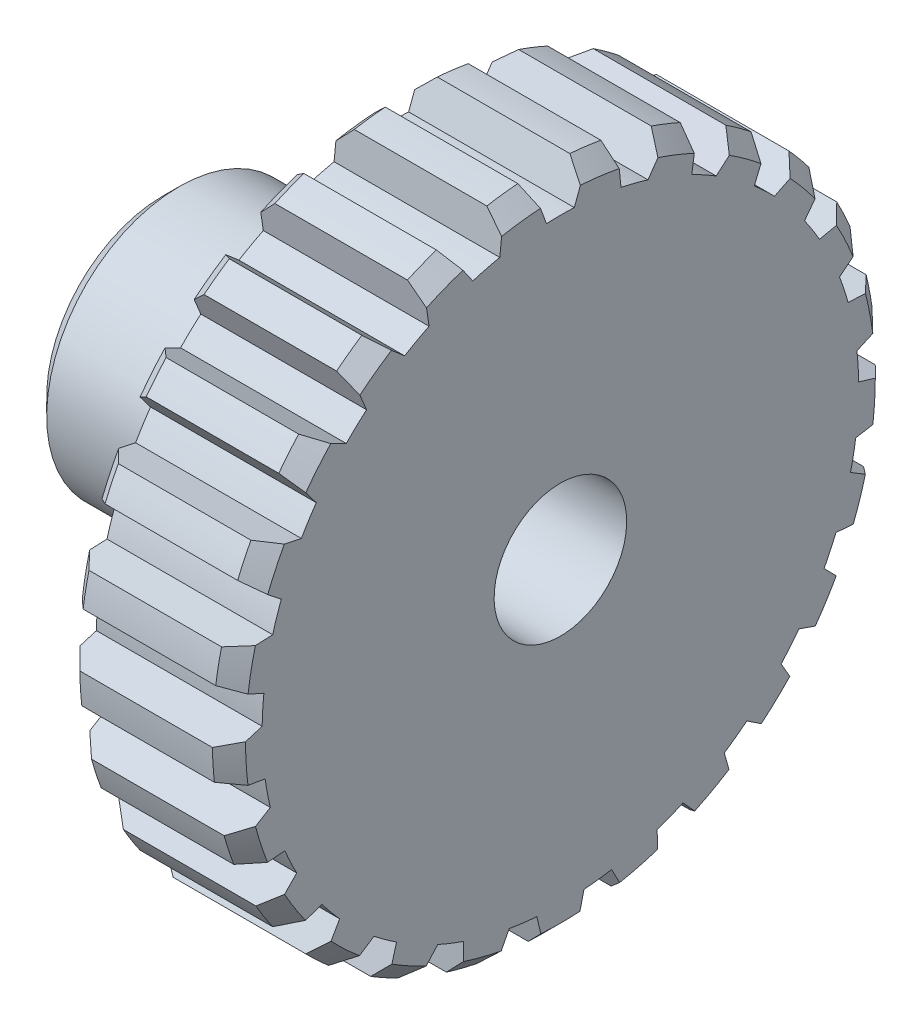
from build123d import *

# Parameters (mm, degrees)
CHAMFER4_SIZE      = 0.5
CUT_EXTRUDE2_DEPTH = 10
SCALE3_SCALE       = 0.85


with BuildPart() as part:
    # Sketch1 → Revolve1 (revolve)
    with BuildSketch(Plane.XY):
        Polygon((0, 2), (-12, 2), (-12, 4), (-5, 4), (-5, 10), (0, 10), align=None)
    revolve(axis=Axis((0, 0, 0), (-1, 0, 0)))

    # Chamfer4
    chamfer4_edges = [part.edges().sort_by_distance(p)[0] for p in [
        (-12, -4, 0),
        (-5, -10, 0),
        (0, -10, 0),
    ]]
    chamfer(chamfer4_edges, length=CHAMFER4_SIZE)

    # Sketch3 → Cut-Extrude2 (cut)
    with BuildSketch(Plane(origin=(0, 0, 0), x_dir=(0, 0, -1), z_dir=(1, 0, 0))):
        with BuildLine():
            Line((-0.785, 9.969141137), (-0.42, 8.990194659))
            ThreePointArc((-0.42, 8.990194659), (0, 9), (0.42, 8.990194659))
            Line((0.42, 8.990194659), (0.785, 9.969141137))
            Line((0.785, 9.969141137), (0.785, 10.77942288))
            ThreePointArc((0.785, 10.77942288), (0, 10.807968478), (-0.785, 10.77942288))
            Line((-0.785, 10.77942288), (-0.785, 9.969141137))
        make_face()
        with BuildLine():
            Line((1.920395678, 10.63598905), (1.718886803, 9.851163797))
            Line((1.718886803, 9.851163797), (1.828965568, 8.812200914))
            ThreePointArc((1.828965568, 8.812200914), (2.238208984, 8.71724845), (2.642575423, 8.603301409))
            Line((2.642575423, 8.603301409), (3.239562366, 9.460720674))
            Line((3.239562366, 9.460720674), (3.441071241, 10.245545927))
            ThreePointArc((3.441071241, 10.245545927), (2.687832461, 10.468416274), (1.920395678, 10.63598905))
        make_face()
        with BuildLine():
            Line((4.505125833, 9.824256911), (4.114769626, 9.114201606))
            Line((4.114769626, 9.114201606), (3.963010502, 8.080504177))
            ThreePointArc((3.963010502, 8.080504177), (4.335783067, 7.88676012), (4.699108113, 7.675831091))
            Line((4.699108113, 7.675831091), (5.490571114, 8.357848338))
            Line((5.490571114, 8.357848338), (5.880927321, 9.067903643))
            ThreePointArc((5.880927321, 9.067903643), (5.206778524, 9.471094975), (4.505125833, 9.824256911))
        make_face()
        with BuildLine():
            Line((6.806782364, 8.39523058), (6.252106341, 7.804560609))
            Line((6.252106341, 7.804560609), (5.848044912, 6.841079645))
            ThreePointArc((5.848044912, 6.841079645), (6.160923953, 6.560717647), (6.460378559, 6.266060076))
            Line((6.460378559, 6.266060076), (7.396587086, 6.729821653))
            Line((7.396587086, 6.729821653), (7.951263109, 7.320491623))
            ThreePointArc((7.951263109, 7.320491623), (7.398563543, 7.878669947), (6.806782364, 8.39523058))
        make_face()
        with BuildLine():
            Line((8.680743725, 6.438701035), (7.996600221, 6.004530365))
            Line((7.996600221, 6.004530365), (7.365625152, 5.171804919))
            ThreePointArc((7.365625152, 5.171804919), (7.59895133, 4.822441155), (7.81571966, 4.462569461))
            Line((7.81571966, 4.462569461), (8.837848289, 4.678935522))
            Line((8.837848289, 4.678935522), (9.521991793, 5.113106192))
            ThreePointArc((9.521991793, 5.113106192), (9.125469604, 5.79119911), (8.680743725, 6.438701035))
        make_face()
        with BuildLine():
            Line((10.009262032, 4.077604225), (9.238638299, 3.827213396))
            Line((9.238638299, 3.827213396), (8.420396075, 3.177566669))
            ThreePointArc((8.420396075, 3.177566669), (8.559508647, 2.781152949), (8.67997035, 2.378679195))
            Line((8.67997035, 2.378679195), (9.72379498, 2.334054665))
            Line((9.72379498, 2.334054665), (10.494418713, 2.584445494))
            ThreePointArc((10.494418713, 2.584445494), (10.278988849, 3.339845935), (10.009262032, 4.077604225))
        make_face()
        with BuildLine():
            Line((10.708861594, 1.460296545), (9.900178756, 1.409418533))
            Line((9.900178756, 1.409418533), (8.946082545, 0.983670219))
            ThreePointArc((8.946082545, 0.983670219), (8.982240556, 0.565114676), (8.998826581, 0.145327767))
            Line((8.998826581, 0.145327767), (9.998759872, -0.157483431))
            Line((9.998759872, -0.157483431), (10.807442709, -0.106605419))
            ThreePointArc((10.807442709, -0.106605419), (10.786641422, 0.678637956), (10.708861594, 1.460296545))
        make_face()
        with BuildLine():
            Line((10.735583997, -1.248766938), (9.939654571, -1.09693528))
            Line((9.939654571, -1.09693528), (8.909653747, -1.272033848))
            ThreePointArc((8.909653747, -1.272033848), (8.840585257, -1.686431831), (8.752253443, -2.097155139))
            Line((8.752253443, -2.097155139), (9.645465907, -2.639126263))
            Line((9.645465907, -2.639126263), (10.441395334, -2.790957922))
            ThreePointArc((10.441395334, -2.790957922), (10.616529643, -2.025211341), (10.735583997, -1.248766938))
        make_face()
        with BuildLine():
            Line((10.087750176, -3.879365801), (9.354585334, -3.534364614))
            Line((9.354585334, -3.534364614), (8.313398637, -3.447811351))
            ThreePointArc((8.313398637, -3.447811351), (8.143443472, -3.832013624), (7.955744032, -4.207866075))
            Line((7.955744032, -4.207866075), (8.686111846, -4.954943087))
            Line((8.686111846, -4.954943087), (9.419276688, -5.299944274))
            ThreePointArc((9.419276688, -5.299944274), (9.779342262, -4.601809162), (10.087750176, -3.879365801))
        make_face()
        with BuildLine():
            Line((8.806065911, -6.266209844), (8.181733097, -5.749716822))
            Line((8.181733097, -5.749716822), (7.194782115, -5.406950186))
            ThreePointArc((7.194782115, -5.406950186), (6.934619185, -5.736815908), (6.659345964, -6.05418131))
            Line((6.659345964, -6.05418131), (7.180977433, -6.959422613))
            Line((7.180977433, -6.959422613), (7.805310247, -7.475915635))
            ThreePointArc((7.805310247, -7.475915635), (8.32768284, -6.889258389), (8.806065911, -6.266209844))
        make_face()
        with BuildLine():
            Line((6.971064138, -8.259324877), (6.494792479, -7.603793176))
            Line((6.494792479, -7.603793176), (5.624090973, -7.026350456))
            ThreePointArc((5.624090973, -7.026350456), (5.290067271, -7.281152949), (4.944516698, -7.520090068))
            Line((4.944516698, -7.520090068), (5.224635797, -8.526616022))
            Line((5.224635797, -8.526616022), (5.700907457, -9.182147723))
            ThreePointArc((5.700907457, -9.182147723), (6.352764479, -8.743830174), (6.971064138, -8.259324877))
        make_face()
        with BuildLine():
            Line((4.698044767, -9.733476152), (4.399760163, -8.980095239))
            Line((4.399760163, -8.980095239), (3.700017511, -8.204259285))
            ThreePointArc((3.700017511, -8.204259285), (3.313120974, -8.367988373), (2.919005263, -8.513483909))
            Line((2.919005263, -8.513483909), (2.94001108, -9.558050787))
            Line((2.94001108, -9.558050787), (3.238295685, -10.311431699))
            ThreePointArc((3.238295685, -10.311431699), (3.978678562, -10.048994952), (4.698044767, -9.733476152))
        make_face()
        with BuildLine():
            Line((2.129829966, -10.596037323), (2.028274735, -9.792144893))
            Line((2.028274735, -9.792144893), (1.543458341, -8.86666433))
            ThreePointArc((1.543458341, -8.86666433), (1.127999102, -8.929032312), (0.710081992, -8.971944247))
            Line((0.710081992, -8.971944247), (0.470654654, -9.988918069))
            Line((0.470654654, -9.988918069), (0.572209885, -10.7928105))
            ThreePointArc((0.572209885, -10.7928105), (1.354597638, -10.722744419), (2.129829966, -10.596037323))
        make_face()
        with BuildLine():
            Line((-0.572209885, -10.7928105), (-0.470654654, -9.988918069))
            Line((-0.470654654, -9.988918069), (-0.710081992, -8.971944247))
            ThreePointArc((-0.710081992, -8.971944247), (-1.127999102, -8.929032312), (-1.543458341, -8.86666433))
            Line((-1.543458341, -8.86666433), (-2.028274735, -9.792144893))
            Line((-2.028274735, -9.792144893), (-2.129829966, -10.596037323))
            ThreePointArc((-2.129829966, -10.596037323), (-1.354597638, -10.722744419), (-0.572209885, -10.7928105))
        make_face()
        with BuildLine():
            Line((-3.238295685, -10.311431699), (-2.94001108, -9.558050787))
            Line((-2.94001108, -9.558050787), (-2.919005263, -8.513483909))
            ThreePointArc((-2.919005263, -8.513483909), (-3.313120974, -8.367988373), (-3.700017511, -8.204259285))
            Line((-3.700017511, -8.204259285), (-4.399760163, -8.980095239))
            Line((-4.399760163, -8.980095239), (-4.698044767, -9.733476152))
            ThreePointArc((-4.698044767, -9.733476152), (-3.978678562, -10.048994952), (-3.238295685, -10.311431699))
        make_face()
        with BuildLine():
            Line((-5.700907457, -9.182147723), (-5.224635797, -8.526616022))
            Line((-5.224635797, -8.526616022), (-4.944516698, -7.520090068))
            ThreePointArc((-4.944516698, -7.520090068), (-5.290067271, -7.281152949), (-5.624090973, -7.026350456))
            Line((-5.624090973, -7.026350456), (-6.494792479, -7.603793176))
            Line((-6.494792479, -7.603793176), (-6.971064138, -8.259324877))
            ThreePointArc((-6.971064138, -8.259324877), (-6.352764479, -8.743830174), (-5.700907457, -9.182147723))
        make_face()
        with BuildLine():
            Line((-7.805310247, -7.475915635), (-7.180977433, -6.959422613))
            Line((-7.180977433, -6.959422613), (-6.659345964, -6.05418131))
            ThreePointArc((-6.659345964, -6.05418131), (-6.934619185, -5.736815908), (-7.194782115, -5.406950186))
            Line((-7.194782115, -5.406950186), (-8.181733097, -5.749716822))
            Line((-8.181733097, -5.749716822), (-8.806065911, -6.266209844))
            ThreePointArc((-8.806065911, -6.266209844), (-8.32768284, -6.889258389), (-7.805310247, -7.475915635))
        make_face()
        with BuildLine():
            Line((-9.419276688, -5.299944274), (-8.686111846, -4.954943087))
            Line((-8.686111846, -4.954943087), (-7.955744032, -4.207866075))
            ThreePointArc((-7.955744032, -4.207866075), (-8.143443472, -3.832013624), (-8.313398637, -3.447811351))
            Line((-8.313398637, -3.447811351), (-9.354585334, -3.534364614))
            Line((-9.354585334, -3.534364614), (-10.087750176, -3.879365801))
            ThreePointArc((-10.087750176, -3.879365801), (-9.779342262, -4.601809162), (-9.419276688, -5.299944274))
        make_face()
        with BuildLine():
            Line((-10.441395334, -2.790957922), (-9.645465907, -2.639126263))
            Line((-9.645465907, -2.639126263), (-8.752253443, -2.097155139))
            ThreePointArc((-8.752253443, -2.097155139), (-8.840585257, -1.686431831), (-8.909653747, -1.272033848))
            Line((-8.909653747, -1.272033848), (-9.939654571, -1.09693528))
            Line((-9.939654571, -1.09693528), (-10.735583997, -1.248766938))
            ThreePointArc((-10.735583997, -1.248766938), (-10.616529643, -2.025211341), (-10.441395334, -2.790957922))
        make_face()
        with BuildLine():
            Line((-10.807442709, -0.106605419), (-9.998759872, -0.157483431))
            Line((-9.998759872, -0.157483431), (-8.998826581, 0.145327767))
            ThreePointArc((-8.998826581, 0.145327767), (-8.982240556, 0.565114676), (-8.946082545, 0.983670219))
            Line((-8.946082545, 0.983670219), (-9.900178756, 1.409418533))
            Line((-9.900178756, 1.409418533), (-10.708861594, 1.460296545))
            ThreePointArc((-10.708861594, 1.460296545), (-10.786641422, 0.678637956), (-10.807442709, -0.106605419))
        make_face()
        with BuildLine():
            Line((-10.494418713, 2.584445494), (-9.72379498, 2.334054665))
            Line((-9.72379498, 2.334054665), (-8.67997035, 2.378679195))
            ThreePointArc((-8.67997035, 2.378679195), (-8.559508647, 2.781152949), (-8.420396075, 3.177566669))
            Line((-8.420396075, 3.177566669), (-9.238638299, 3.827213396))
            Line((-9.238638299, 3.827213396), (-10.009262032, 4.077604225))
            ThreePointArc((-10.009262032, 4.077604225), (-10.278988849, 3.339845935), (-10.494418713, 2.584445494))
        make_face()
        with BuildLine():
            Line((-9.521991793, 5.113106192), (-8.837848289, 4.678935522))
            Line((-8.837848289, 4.678935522), (-7.81571966, 4.462569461))
            ThreePointArc((-7.81571966, 4.462569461), (-7.59895133, 4.822441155), (-7.365625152, 5.171804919))
            Line((-7.365625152, 5.171804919), (-7.996600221, 6.004530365))
            Line((-7.996600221, 6.004530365), (-8.680743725, 6.438701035))
            ThreePointArc((-8.680743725, 6.438701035), (-9.125469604, 5.79119911), (-9.521991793, 5.113106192))
        make_face()
        with BuildLine():
            Line((-7.951263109, 7.320491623), (-7.396587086, 6.729821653))
            Line((-7.396587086, 6.729821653), (-6.460378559, 6.266060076))
            ThreePointArc((-6.460378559, 6.266060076), (-6.160923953, 6.560717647), (-5.848044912, 6.841079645))
            Line((-5.848044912, 6.841079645), (-6.252106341, 7.804560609))
            Line((-6.252106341, 7.804560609), (-6.806782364, 8.39523058))
            ThreePointArc((-6.806782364, 8.39523058), (-7.398563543, 7.878669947), (-7.951263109, 7.320491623))
        make_face()
        with BuildLine():
            Line((-5.880927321, 9.067903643), (-5.490571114, 8.357848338))
            Line((-5.490571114, 8.357848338), (-4.699108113, 7.675831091))
            ThreePointArc((-4.699108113, 7.675831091), (-4.335783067, 7.88676012), (-3.963010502, 8.080504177))
            Line((-3.963010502, 8.080504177), (-4.114769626, 9.114201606))
            Line((-4.114769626, 9.114201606), (-4.505125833, 9.824256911))
            ThreePointArc((-4.505125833, 9.824256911), (-5.206778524, 9.471094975), (-5.880927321, 9.067903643))
        make_face()
        with BuildLine():
            Line((-3.441071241, 10.245545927), (-3.239562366, 9.460720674))
            Line((-3.239562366, 9.460720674), (-2.642575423, 8.603301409))
            ThreePointArc((-2.642575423, 8.603301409), (-2.238208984, 8.71724845), (-1.828965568, 8.812200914))
            Line((-1.828965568, 8.812200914), (-1.718886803, 9.851163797))
            Line((-1.718886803, 9.851163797), (-1.920395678, 10.63598905))
            ThreePointArc((-1.920395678, 10.63598905), (-2.687832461, 10.468416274), (-3.441071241, 10.245545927))
        make_face()
    extrude(amount=-CUT_EXTRUDE2_DEPTH, mode=Mode.SUBTRACT)


with BuildPart() as part_1:
    # Scale3: scaled about (-3.465011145, 0, 0)
    add(part.part.scale(SCALE3_SCALE).moved(Location((-0.519751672, 0, 0))))


solid = part_1.part
